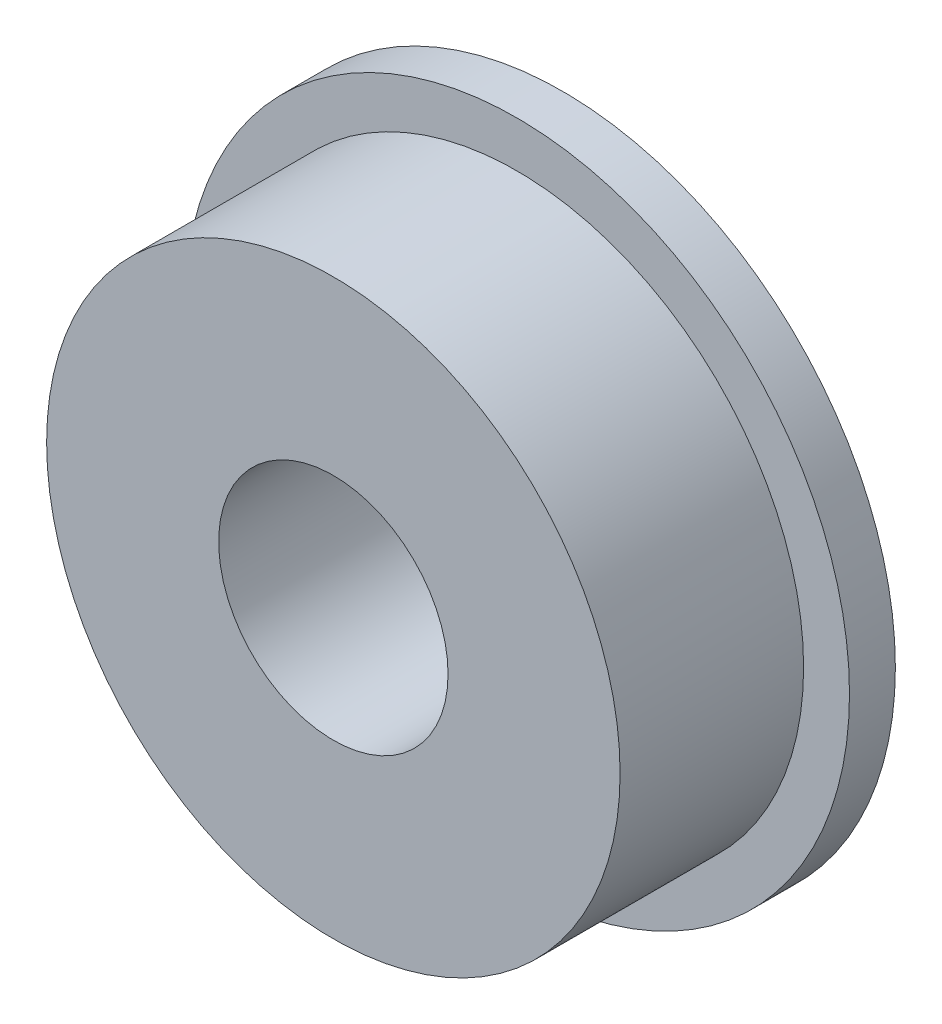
from build123d import *

# Parameters (mm, degrees)
SKETCH1_R          = 5.8
SKETCH1_R_2        = 2
EXTRUDE1_DEPTH     = 4
SKETCH2_OUTSIDE_W  = 16.978
SKETCH2_OUTSIDE_H  = 16.978
SKETCH2_OUTSIDE_R  = 5
CUT_EXTRUDE1_DEPTH = 3.2


with BuildPart() as part:
    # Sketch1 → Extrude1 (new body)
    with BuildSketch(Plane.XY):
        Circle(SKETCH1_R)
        Circle(SKETCH1_R_2, mode=Mode.SUBTRACT)
    extrude(amount=EXTRUDE1_DEPTH)

    # Sketch2 outside → Cut-Extrude1 (cut)
    with BuildSketch(Plane.XY.offset(4)):
        Rectangle(SKETCH2_OUTSIDE_W, SKETCH2_OUTSIDE_H)
        Circle(SKETCH2_OUTSIDE_R, mode=Mode.SUBTRACT)
    extrude(amount=-CUT_EXTRUDE1_DEPTH, mode=Mode.SUBTRACT)


solid = part.part
